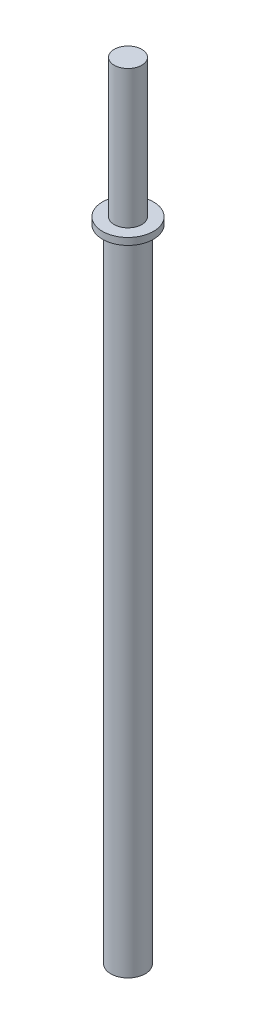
from build123d import *


with BuildPart() as part:
    # Sketch 1 → Revolve 1 (revolve)
    with BuildSketch(Plane.XY):
        Polygon((0, 84.501879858), (0, -29.289815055), (-2.5, -29.289815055), (-2.5, 63.501879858), (-3.7, 63.501879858), (-3.7, 64.501879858), (-2, 64.501879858), (-2, 84.501879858), align=None)
    revolve(axis=Axis((0, 84.501879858, 0), (0, -1, 0)))


solid = part.part
